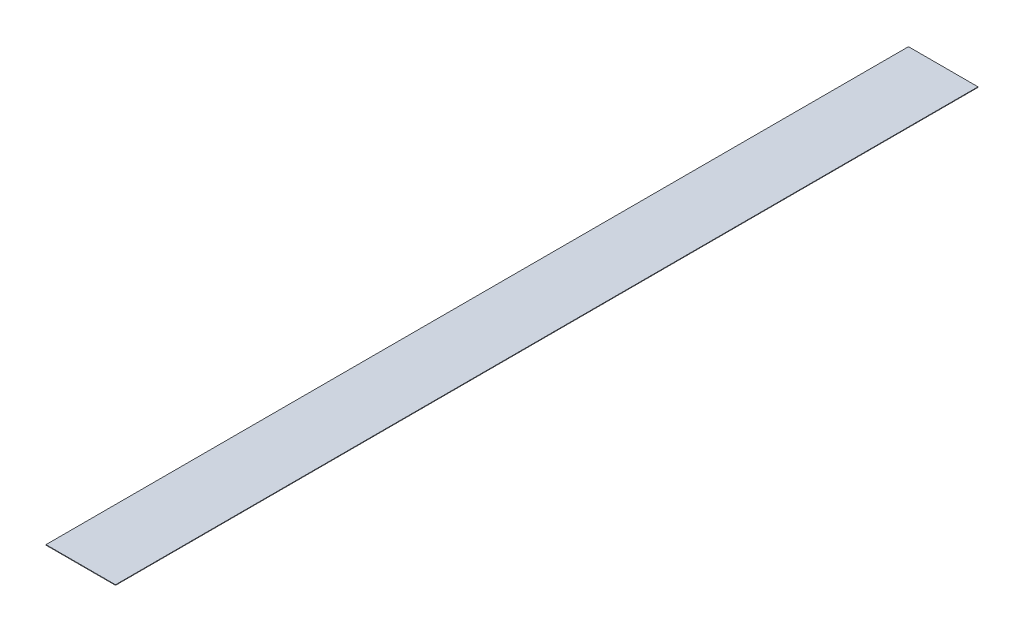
from build123d import *

# Parameters (mm, degrees)
SKETCH1_W      = 24.1054
SKETCH1_H      = 299
EXTRUDE1_DEPTH = 0.175


with BuildPart() as part:
    # Sketch1 → Extrude1 (new body)
    with BuildSketch(Plane(origin=(0, 0, 0), x_dir=(1, 0, 0), z_dir=(0, 1, 0))):
        Rectangle(SKETCH1_W, SKETCH1_H)
    extrude(amount=EXTRUDE1_DEPTH)


solid = part.part
